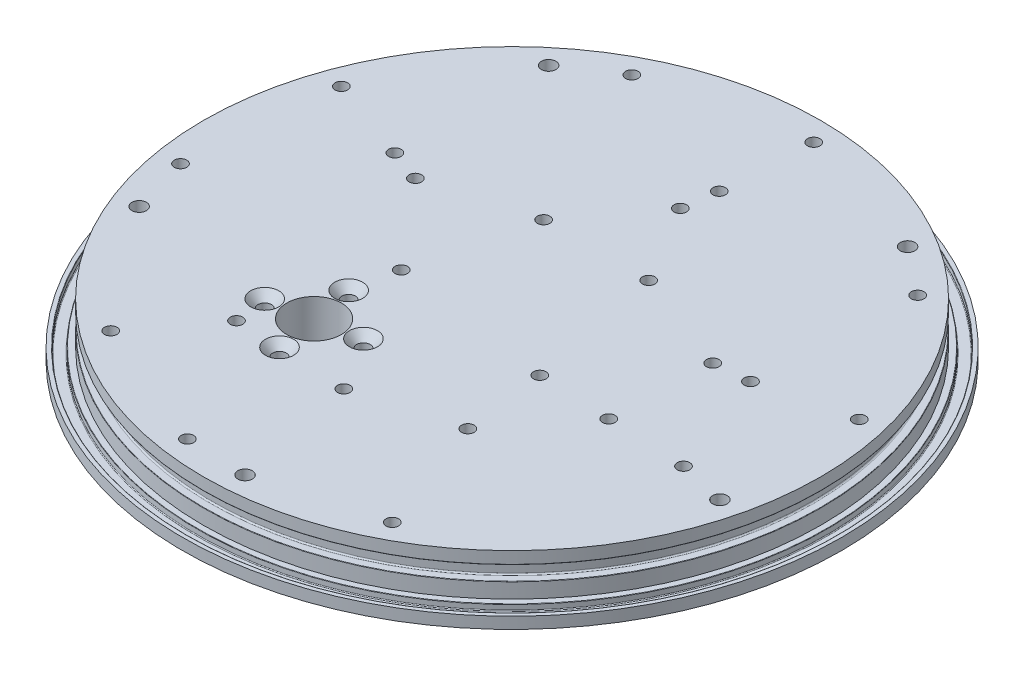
from build123d import *

# Parameters (mm, degrees)
SKETCH19_R                                     = 9.0805
CUT_EXTRUDE4_DEPTH                             = 156.926444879
CSK_FOR_8_FLAT_HEAD_MACHINE_SCREW1_D           = 4.4958
CSK_FOR_8_FLAT_HEAD_MACHINE_SCREW1_CSINK_D     = 9.3159834
CSK_FOR_8_FLAT_HEAD_MACHINE_SCREW1_CSINK_ANGLE = 82
F_10_32_TAPPED_HOLE1_D                         = 4.0386
F_10_32_TAPPED_HOLE1_DEPTH                     = 8.89
F_10_32_TAPPED_HOLE1_CBORE_D                   = 4.826
F_10_32_TAPPED_HOLE1_CBORE_DEPTH               = 7.62
F_10_32_TAPPED_HOLE1_TIP                       = 1.213317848
F_8_32_TAPPED_HOLE1_D                          = 3.4544
F_8_32_TAPPED_HOLE1_DEPTH                      = 10.668
F_8_32_TAPPED_HOLE1_CBORE_D                    = 4.1656
F_8_32_TAPPED_HOLE1_CBORE_DEPTH                = 8.382
F_8_32_TAPPED_HOLE1_TIP                        = 1.037806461
CIRPATTERN3_COUNT                              = 10
CIRPATTERN4_COUNT                              = 10
F_8_32_TAPPED_HOLE4_D                          = 3.4544
F_8_32_TAPPED_HOLE4_DEPTH                      = 10.668
F_8_32_TAPPED_HOLE4_CBORE_D                    = 4.1656
F_8_32_TAPPED_HOLE4_CBORE_DEPTH                = 8.382
F_8_32_TAPPED_HOLE4_TIP                        = 1.037806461


with BuildPart() as part:
    # Sketch1 → Revolve1 (revolve)
    with BuildSketch(Plane.XY, mode=Mode.PRIVATE) as revolve1_sk:
        with BuildLine():
            Line((0, 13.97), (-102.5906, 13.97))
            Line((-102.5906, 13.97), (-102.5906, 10.0203))
            ThreePointArc((-102.5906, 10.0203), (-102.553402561, 9.930497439), (-102.4636, 9.8933))
            Line((-102.4636, 9.8933), (-100.2157, 9.8933))
            ThreePointArc((-100.2157, 9.8933), (-99.901391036, 9.763108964), (-99.7712, 9.4488))
            Line((-99.7712, 9.4488), (-99.7712, 5.5245))
            ThreePointArc((-99.7712, 5.5245), (-99.901391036, 5.210191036), (-100.2157, 5.08))
            Line((-100.2157, 5.08), (-102.4636, 5.08))
            ThreePointArc((-102.4636, 5.08), (-102.553402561, 5.042802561), (-102.5906, 4.953))
            Line((-102.5906, 4.953), (-102.5906, 0))
            Line((-102.5906, 0), (-109.5375, 0))
            Line((-109.5375, 0), (-109.5375, -3.81))
            Line((-109.5375, -3.81), (0, -3.81))
            Line((0, -3.81), (0, 13.97))
        make_face()
    revolve(revolve1_sk.sketch.rotate(Axis((0, 13.97, 0), (0, 1, 0)), 180), axis=Axis((0, 13.97, 0), (0, 1, 0)))

    # Sketch19 → Cut-Extrude4 (cut, through all)
    with BuildSketch(Plane(origin=(0, 13.97, 0), x_dir=(1, 0, 0), z_dir=(0, 1, 0))):
        with Locations(Location((-27.099611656, -38.70225637, 0), (0, 0, 180))):
            Circle(SKETCH19_R)
    extrude(amount=-CUT_EXTRUDE4_DEPTH, mode=Mode.SUBTRACT)

    # Sketch13 → 2-222 O-Ring (revolve, cut)
    with BuildSketch(Plane(origin=(-11.376088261, 0, 16.246737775), x_dir=(0.5735764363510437, 0, -0.8191520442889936), z_dir=(0.8191520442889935, 0, 0.5735764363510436)), mode=Mode.PRIVATE) as f_2_222_o_ring_sk:
        with BuildLine():
            Line((-8.566326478, -3.683), (-8.566326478, -1.6129))
            ThreePointArc((-8.566326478, -1.6129), (-8.436135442, -1.298591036), (-8.121826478, -1.1684))
            Line((-8.121826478, -1.1684), (-4.388026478, -1.1684))
            ThreePointArc((-4.388026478, -1.1684), (-4.073717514, -1.298591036), (-3.943526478, -1.6129))
            Line((-3.943526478, -1.6129), (-3.943526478, -3.683))
            ThreePointArc((-3.943526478, -3.683), (-3.906329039, -3.772802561), (-3.816526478, -3.81))
            Line((-3.816526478, -3.81), (-8.693326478, -3.81))
            ThreePointArc((-8.693326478, -3.81), (-8.603523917, -3.772802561), (-8.566326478, -3.683))
        make_face()
    revolve(f_2_222_o_ring_sk.sketch.rotate(Axis((-27.099611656, 13.97, 38.70225637), (0, -1, 0)), 145), axis=Axis((-27.099611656, 13.97, 38.70225637), (0, -1, 0)), mode=Mode.SUBTRACT)

    # CSK for _8 Flat Head Machine Screw1 (through all)
    with Locations(Plane(origin=(0, 13.97, 0), x_dir=(1, 0, 0), z_dir=(0, 1, 0))):
        with Locations((-29.558556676, -24.756886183), (-41.044981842, -41.16120139), (-24.640666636, -52.647626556), (-13.154241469, -36.24331135)):
            CounterSinkHole(CSK_FOR_8_FLAT_HEAD_MACHINE_SCREW1_D / 2, CSK_FOR_8_FLAT_HEAD_MACHINE_SCREW1_CSINK_D / 2, counter_sink_angle=CSK_FOR_8_FLAT_HEAD_MACHINE_SCREW1_CSINK_ANGLE)

    # 10-32 Tapped Hole1
    with Locations(Plane(origin=(0, 13.97, 0), x_dir=(1, 0, 0), z_dir=(0, 1, 0))):
        with Locations((6.36054956, -95.113762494), (-88.493045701, -35.441011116), (92.424081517, -23.342526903), (-61.052259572, 73.210013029), (50.760674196, 80.687287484)):
            CounterBoreHole(F_10_32_TAPPED_HOLE1_D / 2, F_10_32_TAPPED_HOLE1_CBORE_D / 2, F_10_32_TAPPED_HOLE1_CBORE_DEPTH, depth=F_10_32_TAPPED_HOLE1_DEPTH)
            with Locations((0, 0, -(F_10_32_TAPPED_HOLE1_DEPTH + F_10_32_TAPPED_HOLE1_TIP / 2))):  # 118° drill point
                Cone(0, F_10_32_TAPPED_HOLE1_D / 2, F_10_32_TAPPED_HOLE1_TIP, mode=Mode.SUBTRACT)

    # 8-32 Tapped Hole1
    with Locations(Plane(origin=(0, 13.97, 0), x_dir=(1, 0, 0), z_dir=(0, 1, 0))):
        with Locations((-57.425427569, -75.968260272), (-39.432126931, -52.157230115), (-61.429514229, 22.479428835), (-89.460457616, 32.725903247), (3.516095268, 65.334810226), (5.120527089, 95.136652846), (63.485271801, 15.75443333), (92.454279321, 22.932220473), (76.728320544, -19.750409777)):
            CounterBoreHole(F_8_32_TAPPED_HOLE1_D / 2, F_8_32_TAPPED_HOLE1_CBORE_D / 2, F_8_32_TAPPED_HOLE1_CBORE_DEPTH, depth=F_8_32_TAPPED_HOLE1_DEPTH)
            with Locations((0, 0, -(F_8_32_TAPPED_HOLE1_DEPTH + F_8_32_TAPPED_HOLE1_TIP / 2))):  # 118° drill point
                Cone(0, F_8_32_TAPPED_HOLE1_D / 2, F_8_32_TAPPED_HOLE1_TIP, mode=Mode.SUBTRACT)

    # Sketch26 → 8-32 Tapped Hole2 (revolve, cut)
    with BuildSketch(Plane(origin=(-93.92786088, 13.97, 16.267801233), x_dir=(0, 0, 1), z_dir=(1, 0, 0))):
        Polygon((0, 0), (0, 11.705806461), (1.7272, 10.668), (1.7272, 8.382), (2.0828, 8.382), (2.0828, 0), align=None)
    f_8_32_tapped_hole2 = revolve(axis=Axis((-93.92786088, 20.32, 16.267801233), (0, -1, 0)), mode=Mode.SUBTRACT)

    # CirPattern3: 8-32 Tapped Hole2 ×10 about axis, 5 skipped
    cirpattern3_axis = Axis((0, 56.720606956, 0), (0, -1, 0))
    add([f_8_32_tapped_hole2.rotate(cirpattern3_axis, i * 360 / CIRPATTERN3_COUNT) for i in range(1, CIRPATTERN3_COUNT) if i not in (1, 3, 5, 6, 9)], mode=Mode.SUBTRACT)

    # Sketch30 → 8-32 Tapped Hole3 (revolve, cut)
    with BuildSketch(Plane(origin=(-50.686104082, 13.97, -18.553152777), x_dir=(0, 0, 1), z_dir=(1, 0, 0))):
        Polygon((0, 0), (0, 11.705806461), (1.7272, 10.668), (1.7272, 8.382), (2.0828, 8.382), (2.0828, 0), align=None)
    f_8_32_tapped_hole3 = revolve(axis=Axis((-50.686104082, 20.32, -18.553152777), (0, -1, 0)), mode=Mode.SUBTRACT)

    # CirPattern4: 8-32 Tapped Hole3 ×10 about axis, 4 skipped
    cirpattern4_axis = Axis((0, 56.720606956, 0), (0, -1, 0))
    add([f_8_32_tapped_hole3.rotate(cirpattern4_axis, i * 360 / CIRPATTERN4_COUNT) for i in range(1, CIRPATTERN4_COUNT) if i not in (1, 3, 8, 9)], mode=Mode.SUBTRACT)

    # 8-32 Tapped Hole4
    with Locations(Plane(origin=(0, 13.97, 0), x_dir=(1, 0, 0), z_dir=(0, 1, 0))):
        with Locations((-17.4625, 27.94), (17.4625, 27.94), (26.67, -17.4625), (-26.67, -10.16)):
            CounterBoreHole(F_8_32_TAPPED_HOLE4_D / 2, F_8_32_TAPPED_HOLE4_CBORE_D / 2, F_8_32_TAPPED_HOLE4_CBORE_DEPTH, depth=F_8_32_TAPPED_HOLE4_DEPTH)
            with Locations((0, 0, -(F_8_32_TAPPED_HOLE4_DEPTH + F_8_32_TAPPED_HOLE4_TIP / 2))):  # 118° drill point
                Cone(0, F_8_32_TAPPED_HOLE4_D / 2, F_8_32_TAPPED_HOLE4_TIP, mode=Mode.SUBTRACT)

    # Sketch39 → 2-172 O-Ring (revolve, cut)
    with BuildSketch(Plane.XY, mode=Mode.PRIVATE) as f_2_172_o_ring_sk:
        with BuildLine():
            Line((-108.2675, 0), (-104.4829, 0))
            ThreePointArc((-104.4829, 0), (-104.572702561, -0.037197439), (-104.6099, -0.127))
            Line((-104.6099, -0.127), (-104.6099, -1.7018))
            ThreePointArc((-104.6099, -1.7018), (-104.684294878, -1.881405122), (-104.8639, -1.9558))
            Line((-104.8639, -1.9558), (-107.8865, -1.9558))
            ThreePointArc((-107.8865, -1.9558), (-108.066105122, -1.881405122), (-108.1405, -1.7018))
            Line((-108.1405, -1.7018), (-108.1405, -0.127))
            ThreePointArc((-108.1405, -0.127), (-108.177697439, -0.037197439), (-108.2675, 0))
        make_face()
    revolve(f_2_172_o_ring_sk.sketch.rotate(Axis((0, -456.133279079, 0), (0, 1, 0)), 270), axis=Axis((0, -456.133279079, 0), (0, 1, 0)), mode=Mode.SUBTRACT)


solid = part.part
